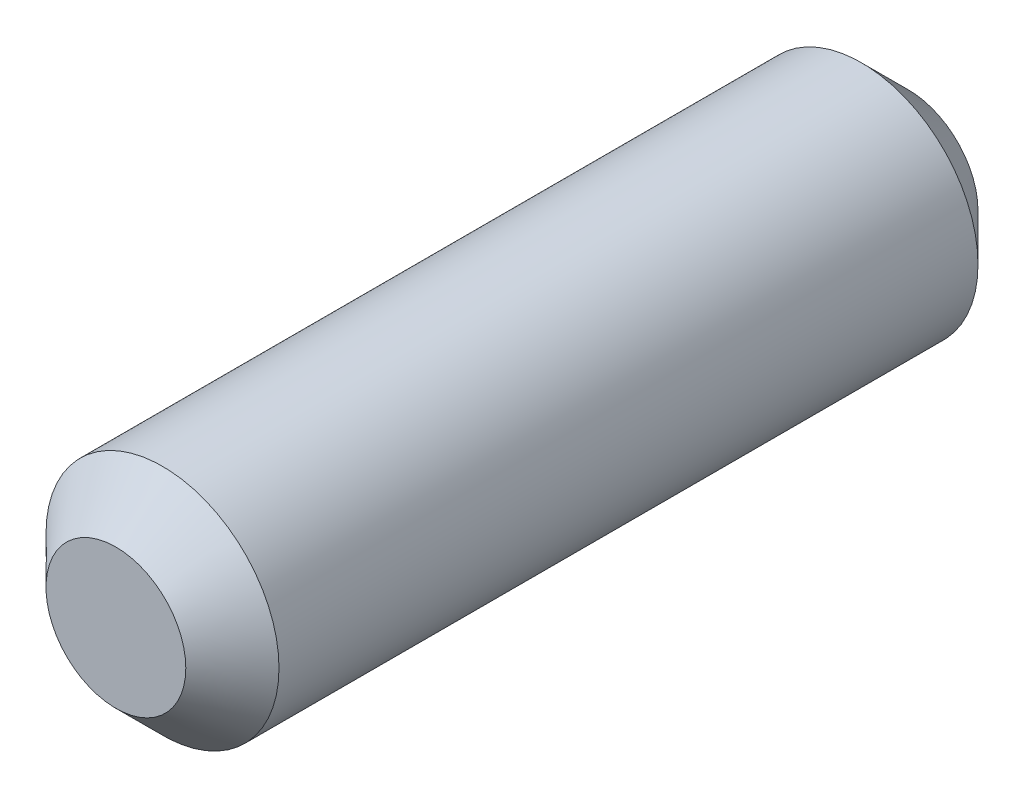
from build123d import *

# Parameters (mm, degrees)
SKETCH1_R           = 1.25
BOSS_EXTRUDE1_DEPTH = 8.5
CHAMFER1_SIZE       = 0.5


with BuildPart() as part:
    # Sketch1 → Boss-Extrude1 (new body)
    with BuildSketch(Plane.XY):
        with Locations((-3.143783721, 6.828683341)):
            Circle(SKETCH1_R)
    extrude(amount=-BOSS_EXTRUDE1_DEPTH)

    # Chamfer1
    chamfer1_edges = [part.edges().sort_by_distance(p)[0] for p in [
        (-4.393783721, 6.828683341, 0),
        (-4.393783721, 6.828683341, -8.5),
    ]]
    chamfer(chamfer1_edges, length=CHAMFER1_SIZE)


solid = part.part
